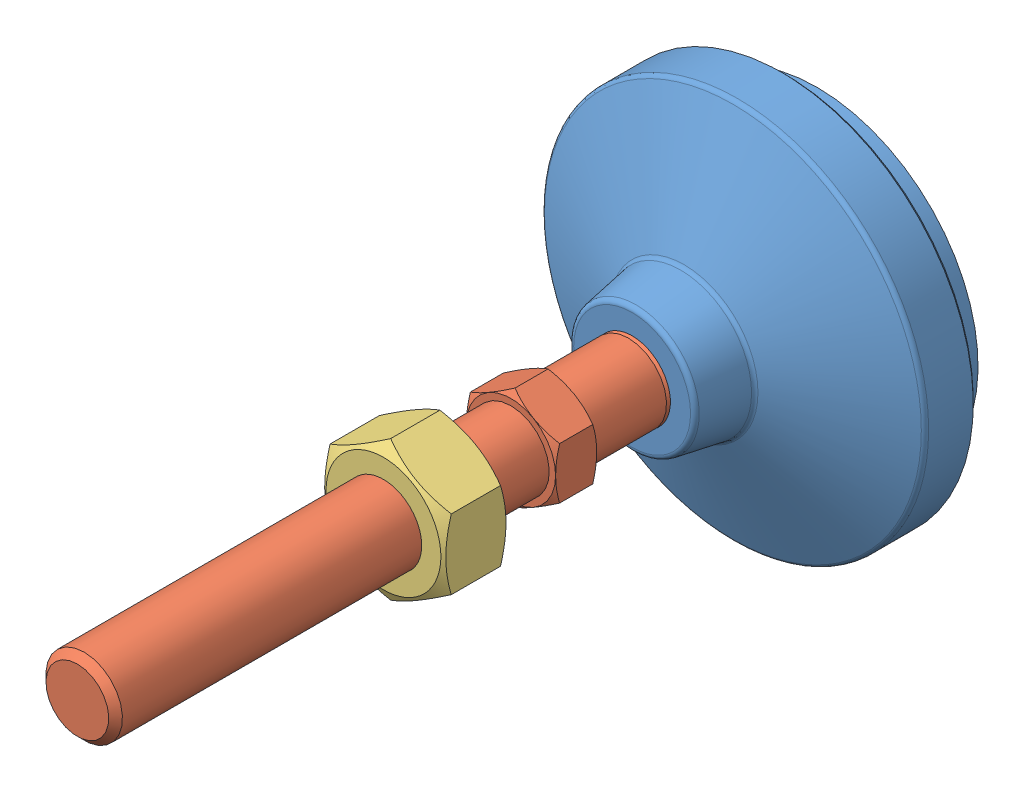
SolidWorks assembly LSVA50-M12X68-SUS.sldasm, configuration Default (file format 15000). Lengths in mm.
Overall size (60 60 116).
3 component instances, 3 part files, 0 mates.
Components (placement in the parent):
- LSVA50-M12X68-SUS_01-1: LSVA50-M12X68-SUS_01.sldprt [Default] at (0 0 5) x (1 0 0) z (0 -1 0) size (60 29 60)
- LSVA50-M12X68-SUS_02-1: LSVA50-M12X68-SUS_02.sldprt [Default] at (0 0 25.4) x (1 0 0) z (0 -1 0) size (14 97.6 16.17)
- LSVA50-M12X68-SUS_03-1: LSVA50-M12X68-SUS_03.sldprt [Default] at (0 0 58) size (19 21.94 10)
